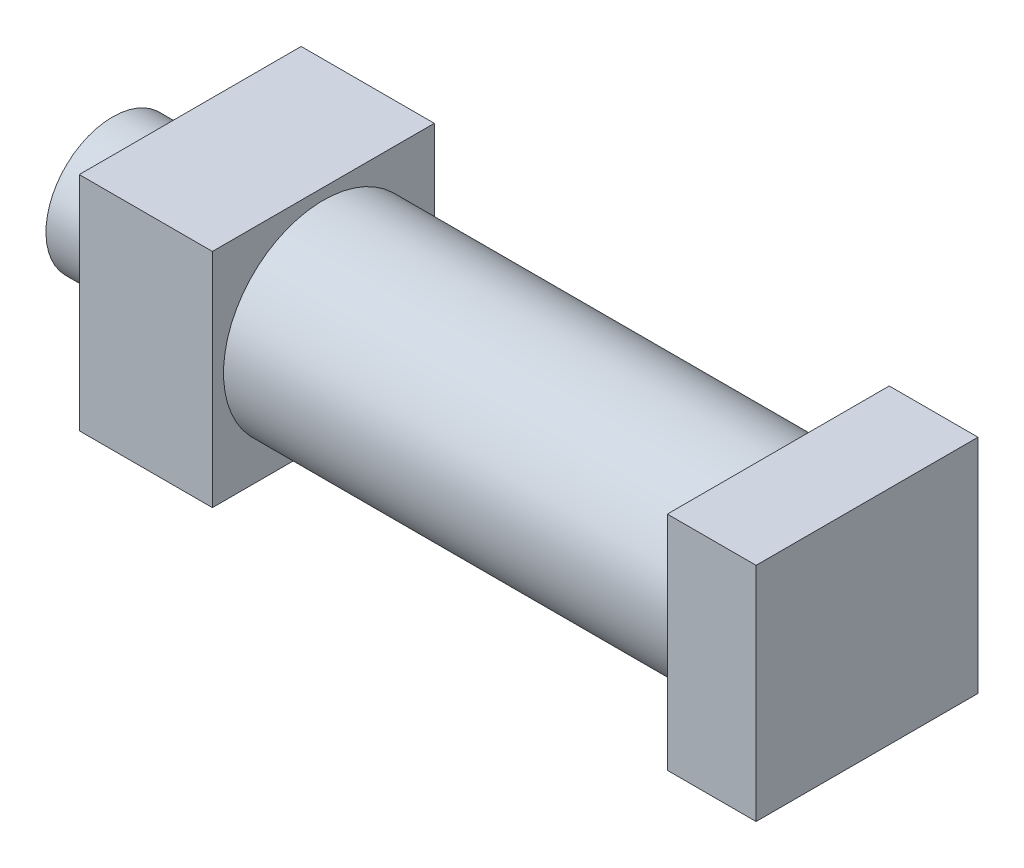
ISO-10303-21;
HEADER;
FILE_DESCRIPTION(('STEP AP214'),'2;1');
FILE_NAME('part.step','',(''),(''),'','','');
FILE_SCHEMA(('AUTOMOTIVE_DESIGN { 1 0 10303 214 1 1 1 1 }'));
ENDSEC;
DATA;
#1=APPLICATION_CONTEXT('core data for automotive mechanical design processes');
#2=APPLICATION_PROTOCOL_DEFINITION('international standard','automotive_design',2000,#1);
#3=PRODUCT_CONTEXT('',#1,'mechanical');
#4=PRODUCT('Part','Part','',(#3));
#5=PRODUCT_RELATED_PRODUCT_CATEGORY('part','',(#4));
#6=PRODUCT_DEFINITION_FORMATION('','',#4);
#7=PRODUCT_DEFINITION_CONTEXT('part definition',#1,'design');
#8=PRODUCT_DEFINITION('design','',#6,#7);
#9=PRODUCT_DEFINITION_SHAPE('','',#8);
#10=(LENGTH_UNIT() NAMED_UNIT(*) SI_UNIT(.MILLI.,.METRE.));
#11=(NAMED_UNIT(*) PLANE_ANGLE_UNIT() SI_UNIT($,.RADIAN.));
#12=(NAMED_UNIT(*) SI_UNIT($,.STERADIAN.) SOLID_ANGLE_UNIT());
#13=UNCERTAINTY_MEASURE_WITH_UNIT(LENGTH_MEASURE(1.E-05),#10,'distance_accuracy_value','');
#14=(GEOMETRIC_REPRESENTATION_CONTEXT(3) GLOBAL_UNCERTAINTY_ASSIGNED_CONTEXT((#13)) GLOBAL_UNIT_ASSIGNED_CONTEXT((#10,
#11,#12)) REPRESENTATION_CONTEXT('',''));
#15=CARTESIAN_POINT('',(0.,0.,0.));
#16=DIRECTION('',(0.,0.,1.));
#17=DIRECTION('',(1.,0.,0.));
#18=AXIS2_PLACEMENT_3D('',#15,#16,#17);
#19=CARTESIAN_POINT('',(-155.575,-31.75,-31.75));
#20=DIRECTION('',(0.,-1.,0.));
#21=DIRECTION('',(0.,0.,-1.));
#22=AXIS2_PLACEMENT_3D('',#19,#20,#21);
#23=PLANE('',#22);
#24=DIRECTION('',(0.,0.,1.));
#25=VECTOR('',#24,1.);
#26=CARTESIAN_POINT('',(-193.675,-31.75,-31.75));
#27=LINE('',#26,#25);
#28=CARTESIAN_POINT('',(-193.675,-31.75,-31.75));
#29=VERTEX_POINT('',#28);
#30=CARTESIAN_POINT('',(-193.675,-31.75,31.75));
#31=VERTEX_POINT('',#30);
#32=EDGE_CURVE('E145',#29,#31,#27,.T.);
#33=ORIENTED_EDGE('',*,*,#32,.F.);
#34=DIRECTION('',(-1.,0.,0.));
#35=VECTOR('',#34,1.);
#36=CARTESIAN_POINT('',(-155.575,-31.75,-31.75));
#37=LINE('',#36,#35);
#38=CARTESIAN_POINT('',(-155.575,-31.75,-31.75));
#39=VERTEX_POINT('',#38);
#40=EDGE_CURVE('E133',#39,#29,#37,.T.);
#41=ORIENTED_EDGE('',*,*,#40,.F.);
#42=DIRECTION('',(0.,0.,1.));
#43=VECTOR('',#42,1.);
#44=CARTESIAN_POINT('',(-155.575,-31.75,-31.75));
#45=LINE('',#44,#43);
#46=CARTESIAN_POINT('',(-155.575,-31.75,31.75));
#47=VERTEX_POINT('',#46);
#48=EDGE_CURVE('E127',#39,#47,#45,.T.);
#49=ORIENTED_EDGE('',*,*,#48,.T.);
#50=DIRECTION('',(-1.,0.,0.));
#51=VECTOR('',#50,1.);
#52=CARTESIAN_POINT('',(-155.575,-31.75,31.75));
#53=LINE('',#52,#51);
#54=EDGE_CURVE('E108',#47,#31,#53,.T.);
#55=ORIENTED_EDGE('',*,*,#54,.T.);
#56=EDGE_LOOP('',(#33,#41,#49,#55));
#57=FACE_BOUND('',#56,.T.);
#58=CARTESIAN_POINT('',(-174.625,-31.7499999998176,-11.1125));
#59=DIRECTION('',(0.,-1.,0.));
#60=DIRECTION('',(0.,0.,-1.));
#61=AXIS2_PLACEMENT_3D('',#58,#59,#60);
#62=CIRCLE('',#61,3.96874999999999);
#63=CARTESIAN_POINT('',(-174.625,-31.7499999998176,-15.08125));
#64=VERTEX_POINT('',#63);
#65=EDGE_CURVE('E291',#64,#64,#62,.T.);
#66=ORIENTED_EDGE('',*,*,#65,.F.);
#67=EDGE_LOOP('',(#66));
#68=FACE_BOUND('',#67,.T.);
#69=CARTESIAN_POINT('',(-174.625,-31.7499999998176,11.1125));
#70=DIRECTION('',(0.,1.,0.));
#71=DIRECTION('',(0.,0.,1.));
#72=AXIS2_PLACEMENT_3D('',#69,#70,#71);
#73=CIRCLE('',#72,3.96874999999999);
#74=CARTESIAN_POINT('',(-174.625,-31.7499999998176,7.14375));
#75=VERTEX_POINT('',#74);
#76=EDGE_CURVE('E292',#75,#75,#73,.T.);
#77=ORIENTED_EDGE('',*,*,#76,.T.);
#78=EDGE_LOOP('',(#77));
#79=FACE_BOUND('',#78,.T.);
#80=ADVANCED_FACE('F32',(#57,#68,#79),#23,.T.);
#81=CARTESIAN_POINT('',(-25.4,-31.75,-31.75));
#82=DIRECTION('',(0.,1.,0.));
#83=DIRECTION('',(0.,0.,1.));
#84=AXIS2_PLACEMENT_3D('',#81,#82,#83);
#85=PLANE('',#84);
#86=DIRECTION('',(0.,0.,1.));
#87=VECTOR('',#86,1.);
#88=CARTESIAN_POINT('',(0.,-31.75,-31.75));
#89=LINE('',#88,#87);
#90=CARTESIAN_POINT('',(0.,-31.75,-31.75));
#91=VERTEX_POINT('',#90);
#92=CARTESIAN_POINT('',(0.,-31.75,31.75));
#93=VERTEX_POINT('',#92);
#94=EDGE_CURVE('E175',#91,#93,#89,.T.);
#95=ORIENTED_EDGE('',*,*,#94,.T.);
#96=DIRECTION('',(1.,0.,0.));
#97=VECTOR('',#96,1.);
#98=CARTESIAN_POINT('',(-25.4,-31.75,31.75));
#99=LINE('',#98,#97);
#100=CARTESIAN_POINT('',(-25.4,-31.75,31.75));
#101=VERTEX_POINT('',#100);
#102=EDGE_CURVE('E172',#101,#93,#99,.T.);
#103=ORIENTED_EDGE('',*,*,#102,.F.);
#104=DIRECTION('',(0.,0.,1.));
#105=VECTOR('',#104,1.);
#106=CARTESIAN_POINT('',(-25.4,-31.75,-31.75));
#107=LINE('',#106,#105);
#108=CARTESIAN_POINT('',(-25.4,-31.75,-31.75));
#109=VERTEX_POINT('',#108);
#110=EDGE_CURVE('E79',#109,#101,#107,.T.);
#111=ORIENTED_EDGE('',*,*,#110,.F.);
#112=DIRECTION('',(1.,0.,0.));
#113=VECTOR('',#112,1.);
#114=CARTESIAN_POINT('',(-25.4,-31.75,-31.75));
#115=LINE('',#114,#113);
#116=EDGE_CURVE('E184',#109,#91,#115,.T.);
#117=ORIENTED_EDGE('',*,*,#116,.T.);
#118=EDGE_LOOP('',(#95,#103,#111,#117));
#119=FACE_BOUND('',#118,.T.);
#120=CARTESIAN_POINT('',(-12.7,-31.7499999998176,-11.1125));
#121=DIRECTION('',(0.,-1.,0.));
#122=DIRECTION('',(0.,0.,-1.));
#123=AXIS2_PLACEMENT_3D('',#120,#121,#122);
#124=CIRCLE('',#123,3.96874999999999);
#125=CARTESIAN_POINT('',(-12.7,-31.7499999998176,-15.08125));
#126=VERTEX_POINT('',#125);
#127=EDGE_CURVE('E306',#126,#126,#124,.T.);
#128=ORIENTED_EDGE('',*,*,#127,.F.);
#129=EDGE_LOOP('',(#128));
#130=FACE_BOUND('',#129,.T.);
#131=CARTESIAN_POINT('',(-12.7,-31.7499999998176,11.1125));
#132=DIRECTION('',(0.,1.,0.));
#133=DIRECTION('',(0.,0.,1.));
#134=AXIS2_PLACEMENT_3D('',#131,#132,#133);
#135=CIRCLE('',#134,3.96874999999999);
#136=CARTESIAN_POINT('',(-12.7,-31.7499999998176,7.14375000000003));
#137=VERTEX_POINT('',#136);
#138=EDGE_CURVE('E301',#137,#137,#135,.T.);
#139=ORIENTED_EDGE('',*,*,#138,.T.);
#140=EDGE_LOOP('',(#139));
#141=FACE_BOUND('',#140,.T.);
#142=ADVANCED_FACE('F211',(#119,#130,#141),#85,.F.);
#143=CARTESIAN_POINT('',(-25.4,-31.75,31.75));
#144=DIRECTION('',(-1.,0.,0.));
#145=DIRECTION('',(0.,0.,1.));
#146=AXIS2_PLACEMENT_3D('',#143,#144,#145);
#147=PLANE('',#146);
#148=DIRECTION('',(0.,-1.,0.));
#149=VECTOR('',#148,1.);
#150=CARTESIAN_POINT('',(-25.4,31.75,31.75));
#151=LINE('',#150,#149);
#152=CARTESIAN_POINT('',(-25.4,31.75,31.75));
#153=VERTEX_POINT('',#152);
#154=EDGE_CURVE('E164',#153,#101,#151,.T.);
#155=ORIENTED_EDGE('',*,*,#154,.F.);
#156=DIRECTION('',(0.,0.,-1.));
#157=VECTOR('',#156,1.);
#158=CARTESIAN_POINT('',(-25.4,31.75,31.75));
#159=LINE('',#158,#157);
#160=CARTESIAN_POINT('',(-25.4,31.75,-31.75));
#161=VERTEX_POINT('',#160);
#162=EDGE_CURVE('E170',#153,#161,#159,.T.);
#163=ORIENTED_EDGE('',*,*,#162,.T.);
#164=DIRECTION('',(0.,1.,0.));
#165=VECTOR('',#164,1.);
#166=CARTESIAN_POINT('',(-25.4,-31.75,-31.75));
#167=LINE('',#166,#165);
#168=EDGE_CURVE('E168',#109,#161,#167,.T.);
#169=ORIENTED_EDGE('',*,*,#168,.F.);
#170=ORIENTED_EDGE('',*,*,#110,.T.);
#171=EDGE_LOOP('',(#155,#163,#169,#170));
#172=FACE_BOUND('',#171,.T.);
#173=CARTESIAN_POINT('',(-25.4,0.,0.));
#174=DIRECTION('',(-1.,0.,0.));
#175=DIRECTION('',(0.,0.,1.));
#176=AXIS2_PLACEMENT_3D('',#173,#174,#175);
#177=CIRCLE('',#176,28.575);
#178=CARTESIAN_POINT('',(-25.4,0.,28.575));
#179=VERTEX_POINT('',#178);
#180=EDGE_CURVE('E157',#179,#179,#177,.F.);
#181=ORIENTED_EDGE('',*,*,#180,.T.);
#182=EDGE_LOOP('',(#181));
#183=FACE_BOUND('',#182,.T.);
#184=ADVANCED_FACE('F201',(#172,#183),#147,.T.);
#185=CARTESIAN_POINT('',(-25.4,31.75,31.75));
#186=DIRECTION('',(0.,0.,1.));
#187=DIRECTION('',(0.,-1.,0.));
#188=AXIS2_PLACEMENT_3D('',#185,#186,#187);
#189=PLANE('',#188);
#190=DIRECTION('',(0.,-1.,0.));
#191=VECTOR('',#190,1.);
#192=CARTESIAN_POINT('',(0.,31.75,31.75));
#193=LINE('',#192,#191);
#194=CARTESIAN_POINT('',(0.,31.75,31.75));
#195=VERTEX_POINT('',#194);
#196=EDGE_CURVE('E163',#195,#93,#193,.T.);
#197=ORIENTED_EDGE('',*,*,#196,.F.);
#198=DIRECTION('',(1.,0.,0.));
#199=VECTOR('',#198,1.);
#200=CARTESIAN_POINT('',(-25.4,31.75,31.75));
#201=LINE('',#200,#199);
#202=EDGE_CURVE('E49',#153,#195,#201,.T.);
#203=ORIENTED_EDGE('',*,*,#202,.F.);
#204=ORIENTED_EDGE('',*,*,#154,.T.);
#205=ORIENTED_EDGE('',*,*,#102,.T.);
#206=EDGE_LOOP('',(#197,#203,#204,#205));
#207=FACE_BOUND('',#206,.T.);
#208=ADVANCED_FACE('F34',(#207),#189,.T.);
#209=CARTESIAN_POINT('',(-25.4,31.75,31.75));
#210=DIRECTION('',(0.,-1.,0.));
#211=DIRECTION('',(0.,0.,-1.));
#212=AXIS2_PLACEMENT_3D('',#209,#210,#211);
#213=PLANE('',#212);
#214=DIRECTION('',(0.,0.,-1.));
#215=VECTOR('',#214,1.);
#216=CARTESIAN_POINT('',(0.,31.75,31.75));
#217=LINE('',#216,#215);
#218=CARTESIAN_POINT('',(0.,31.75,-31.75));
#219=VERTEX_POINT('',#218);
#220=EDGE_CURVE('E166',#195,#219,#217,.T.);
#221=ORIENTED_EDGE('',*,*,#220,.T.);
#222=DIRECTION('',(1.,0.,0.));
#223=VECTOR('',#222,1.);
#224=CARTESIAN_POINT('',(-25.4,31.75,-31.75));
#225=LINE('',#224,#223);
#226=EDGE_CURVE('E68',#161,#219,#225,.T.);
#227=ORIENTED_EDGE('',*,*,#226,.F.);
#228=ORIENTED_EDGE('',*,*,#162,.F.);
#229=ORIENTED_EDGE('',*,*,#202,.T.);
#230=EDGE_LOOP('',(#221,#227,#228,#229));
#231=FACE_BOUND('',#230,.T.);
#232=ADVANCED_FACE('F435',(#231),#213,.F.);
#233=CARTESIAN_POINT('',(-25.4,-31.75,-31.75));
#234=DIRECTION('',(0.,0.,-1.));
#235=DIRECTION('',(0.,1.,0.));
#236=AXIS2_PLACEMENT_3D('',#233,#234,#235);
#237=PLANE('',#236);
#238=DIRECTION('',(0.,1.,0.));
#239=VECTOR('',#238,1.);
#240=CARTESIAN_POINT('',(0.,-31.75,-31.75));
#241=LINE('',#240,#239);
#242=EDGE_CURVE('E178',#91,#219,#241,.T.);
#243=ORIENTED_EDGE('',*,*,#242,.F.);
#244=ORIENTED_EDGE('',*,*,#116,.F.);
#245=ORIENTED_EDGE('',*,*,#168,.T.);
#246=ORIENTED_EDGE('',*,*,#226,.T.);
#247=EDGE_LOOP('',(#243,#244,#245,#246));
#248=FACE_BOUND('',#247,.T.);
#249=ADVANCED_FACE('F441',(#248),#237,.T.);
#250=CARTESIAN_POINT('',(0.,-31.75,31.75));
#251=DIRECTION('',(-1.,0.,0.));
#252=DIRECTION('',(0.,0.,1.));
#253=AXIS2_PLACEMENT_3D('',#250,#251,#252);
#254=PLANE('',#253);
#255=ORIENTED_EDGE('',*,*,#196,.T.);
#256=ORIENTED_EDGE('',*,*,#94,.F.);
#257=ORIENTED_EDGE('',*,*,#242,.T.);
#258=ORIENTED_EDGE('',*,*,#220,.F.);
#259=EDGE_LOOP('',(#255,#256,#257,#258));
#260=FACE_BOUND('',#259,.T.);
#261=ADVANCED_FACE('F223',(#260),#254,.F.);
#262=CARTESIAN_POINT('',(-274.497305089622,0.,0.));
#263=DIRECTION('',(1.,0.,0.));
#264=DIRECTION('',(0.,0.,-1.));
#265=AXIS2_PLACEMENT_3D('',#262,#263,#264);
#266=CYLINDRICAL_SURFACE('',#265,28.575);
#267=CARTESIAN_POINT('',(-155.575,0.,0.));
#268=DIRECTION('',(1.,0.,0.));
#269=DIRECTION('',(0.,0.,-1.));
#270=AXIS2_PLACEMENT_3D('',#267,#268,#269);
#271=CIRCLE('',#270,28.575);
#272=CARTESIAN_POINT('',(-155.575,0.,-28.575));
#273=VERTEX_POINT('',#272);
#274=EDGE_CURVE('E151',#273,#273,#271,.T.);
#275=ORIENTED_EDGE('',*,*,#274,.T.);
#276=EDGE_LOOP('',(#275));
#277=FACE_BOUND('',#276,.T.);
#278=ORIENTED_EDGE('',*,*,#180,.F.);
#279=EDGE_LOOP('',(#278));
#280=FACE_BOUND('',#279,.T.);
#281=ADVANCED_FACE('F221',(#277,#280),#266,.T.);
#282=CARTESIAN_POINT('',(-155.575,-31.75,-31.75));
#283=DIRECTION('',(1.,0.,0.));
#284=DIRECTION('',(0.,0.,-1.));
#285=AXIS2_PLACEMENT_3D('',#282,#283,#284);
#286=PLANE('',#285);
#287=ORIENTED_EDGE('',*,*,#48,.F.);
#288=DIRECTION('',(0.,-1.,0.));
#289=VECTOR('',#288,1.);
#290=CARTESIAN_POINT('',(-155.575,31.75,-31.75));
#291=LINE('',#290,#289);
#292=CARTESIAN_POINT('',(-155.575,31.75,-31.75));
#293=VERTEX_POINT('',#292);
#294=EDGE_CURVE('E119',#293,#39,#291,.T.);
#295=ORIENTED_EDGE('',*,*,#294,.F.);
#296=DIRECTION('',(0.,0.,-1.));
#297=VECTOR('',#296,1.);
#298=CARTESIAN_POINT('',(-155.575,31.75,31.75));
#299=LINE('',#298,#297);
#300=CARTESIAN_POINT('',(-155.575,31.75,31.75));
#301=VERTEX_POINT('',#300);
#302=EDGE_CURVE('E130',#301,#293,#299,.T.);
#303=ORIENTED_EDGE('',*,*,#302,.F.);
#304=DIRECTION('',(0.,1.,0.));
#305=VECTOR('',#304,1.);
#306=CARTESIAN_POINT('',(-155.575,-31.75,31.75));
#307=LINE('',#306,#305);
#308=EDGE_CURVE('E111',#47,#301,#307,.T.);
#309=ORIENTED_EDGE('',*,*,#308,.F.);
#310=EDGE_LOOP('',(#287,#295,#303,#309));
#311=FACE_BOUND('',#310,.T.);
#312=ORIENTED_EDGE('',*,*,#274,.F.);
#313=EDGE_LOOP('',(#312));
#314=FACE_BOUND('',#313,.T.);
#315=ADVANCED_FACE('F124',(#311,#314),#286,.T.);
#316=CARTESIAN_POINT('',(-155.575,31.75,-31.75));
#317=DIRECTION('',(0.,0.,-1.));
#318=DIRECTION('',(0.,1.,0.));
#319=AXIS2_PLACEMENT_3D('',#316,#317,#318);
#320=PLANE('',#319);
#321=DIRECTION('',(0.,-1.,0.));
#322=VECTOR('',#321,1.);
#323=CARTESIAN_POINT('',(-193.675,31.75,-31.75));
#324=LINE('',#323,#322);
#325=CARTESIAN_POINT('',(-193.675,31.75,-31.75));
#326=VERTEX_POINT('',#325);
#327=EDGE_CURVE('E134',#326,#29,#324,.T.);
#328=ORIENTED_EDGE('',*,*,#327,.F.);
#329=DIRECTION('',(-1.,0.,0.));
#330=VECTOR('',#329,1.);
#331=CARTESIAN_POINT('',(-155.575,31.75,-31.75));
#332=LINE('',#331,#330);
#333=EDGE_CURVE('E152',#293,#326,#332,.T.);
#334=ORIENTED_EDGE('',*,*,#333,.F.);
#335=ORIENTED_EDGE('',*,*,#294,.T.);
#336=ORIENTED_EDGE('',*,*,#40,.T.);
#337=EDGE_LOOP('',(#328,#334,#335,#336));
#338=FACE_BOUND('',#337,.T.);
#339=ADVANCED_FACE('F242',(#338),#320,.T.);
#340=CARTESIAN_POINT('',(-155.575,31.75,31.75));
#341=DIRECTION('',(0.,1.,0.));
#342=DIRECTION('',(-1.,0.,0.));
#343=AXIS2_PLACEMENT_3D('',#340,#341,#342);
#344=PLANE('',#343);
#345=DIRECTION('',(0.,0.,-1.));
#346=VECTOR('',#345,1.);
#347=CARTESIAN_POINT('',(-193.675,31.75,31.75));
#348=LINE('',#347,#346);
#349=CARTESIAN_POINT('',(-193.675,31.75,31.75));
#350=VERTEX_POINT('',#349);
#351=EDGE_CURVE('E137',#350,#326,#348,.T.);
#352=ORIENTED_EDGE('',*,*,#351,.F.);
#353=DIRECTION('',(-1.,0.,0.));
#354=VECTOR('',#353,1.);
#355=CARTESIAN_POINT('',(-155.575,31.75,31.75));
#356=LINE('',#355,#354);
#357=EDGE_CURVE('E118',#301,#350,#356,.T.);
#358=ORIENTED_EDGE('',*,*,#357,.F.);
#359=ORIENTED_EDGE('',*,*,#302,.T.);
#360=ORIENTED_EDGE('',*,*,#333,.T.);
#361=EDGE_LOOP('',(#352,#358,#359,#360));
#362=FACE_BOUND('',#361,.T.);
#363=ADVANCED_FACE('F236',(#362),#344,.T.);
#364=CARTESIAN_POINT('',(-155.575,-31.75,31.75));
#365=DIRECTION('',(0.,0.,1.));
#366=DIRECTION('',(0.,-1.,0.));
#367=AXIS2_PLACEMENT_3D('',#364,#365,#366);
#368=PLANE('',#367);
#369=DIRECTION('',(0.,1.,0.));
#370=VECTOR('',#369,1.);
#371=CARTESIAN_POINT('',(-193.675,-31.75,31.75));
#372=LINE('',#371,#370);
#373=EDGE_CURVE('E113',#31,#350,#372,.T.);
#374=ORIENTED_EDGE('',*,*,#373,.F.);
#375=ORIENTED_EDGE('',*,*,#54,.F.);
#376=ORIENTED_EDGE('',*,*,#308,.T.);
#377=ORIENTED_EDGE('',*,*,#357,.T.);
#378=EDGE_LOOP('',(#374,#375,#376,#377));
#379=FACE_BOUND('',#378,.T.);
#380=ADVANCED_FACE('F110',(#379),#368,.T.);
#381=CARTESIAN_POINT('',(-193.675,0.,0.));
#382=DIRECTION('',(-1.,0.,0.));
#383=DIRECTION('',(0.,-1.,0.));
#384=AXIS2_PLACEMENT_3D('',#381,#382,#383);
#385=PLANE('',#384);
#386=CARTESIAN_POINT('',(-193.675,0.,0.));
#387=DIRECTION('',(-1.,0.,0.));
#388=DIRECTION('',(0.,-1.,0.));
#389=AXIS2_PLACEMENT_3D('',#386,#387,#388);
#390=CIRCLE('',#389,19.05);
#391=CARTESIAN_POINT('',(-193.675,-19.05,0.));
#392=VERTEX_POINT('',#391);
#393=EDGE_CURVE('E11',#392,#392,#390,.T.);
#394=ORIENTED_EDGE('',*,*,#393,.F.);
#395=EDGE_LOOP('',(#394));
#396=FACE_BOUND('',#395,.T.);
#397=ORIENTED_EDGE('',*,*,#32,.T.);
#398=ORIENTED_EDGE('',*,*,#373,.T.);
#399=ORIENTED_EDGE('',*,*,#351,.T.);
#400=ORIENTED_EDGE('',*,*,#327,.T.);
#401=EDGE_LOOP('',(#397,#398,#399,#400));
#402=FACE_BOUND('',#401,.T.);
#403=ADVANCED_FACE('F225',(#396,#402),#385,.T.);
#404=CARTESIAN_POINT('',(-215.9,0.,0.));
#405=DIRECTION('',(1.,0.,0.));
#406=DIRECTION('',(0.,1.,0.));
#407=AXIS2_PLACEMENT_3D('',#404,#405,#406);
#408=CYLINDRICAL_SURFACE('',#407,19.05);
#409=CARTESIAN_POINT('',(-215.9,0.,0.));
#410=DIRECTION('',(1.,0.,0.));
#411=DIRECTION('',(0.,1.,0.));
#412=AXIS2_PLACEMENT_3D('',#409,#410,#411);
#413=CIRCLE('',#412,19.05);
#414=CARTESIAN_POINT('',(-215.9,19.05,0.));
#415=VERTEX_POINT('',#414);
#416=EDGE_CURVE('E140',#415,#415,#413,.T.);
#417=ORIENTED_EDGE('',*,*,#416,.T.);
#418=EDGE_LOOP('',(#417));
#419=FACE_BOUND('',#418,.T.);
#420=ORIENTED_EDGE('',*,*,#393,.T.);
#421=EDGE_LOOP('',(#420));
#422=FACE_BOUND('',#421,.T.);
#423=ADVANCED_FACE('F227',(#419,#422),#408,.T.);
#424=CARTESIAN_POINT('',(-215.9,0.,0.));
#425=DIRECTION('',(1.,0.,0.));
#426=DIRECTION('',(0.,1.,0.));
#427=AXIS2_PLACEMENT_3D('',#424,#425,#426);
#428=PLANE('',#427);
#429=CARTESIAN_POINT('',(-215.9,0.,0.));
#430=DIRECTION('',(-1.,0.,0.));
#431=DIRECTION('',(0.,-1.,0.));
#432=AXIS2_PLACEMENT_3D('',#429,#430,#431);
#433=CIRCLE('',#432,12.7);
#434=CARTESIAN_POINT('',(-215.9,-12.7,0.));
#435=VERTEX_POINT('',#434);
#436=EDGE_CURVE('E312',#435,#435,#433,.T.);
#437=ORIENTED_EDGE('',*,*,#436,.F.);
#438=EDGE_LOOP('',(#437));
#439=FACE_BOUND('',#438,.T.);
#440=ORIENTED_EDGE('',*,*,#416,.F.);
#441=EDGE_LOOP('',(#440));
#442=FACE_BOUND('',#441,.T.);
#443=ADVANCED_FACE('F233',(#439,#442),#428,.F.);
#444=CARTESIAN_POINT('',(10.5210244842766,0.,0.));
#445=DIRECTION('',(-1.,0.,0.));
#446=DIRECTION('',(0.,-1.,0.));
#447=AXIS2_PLACEMENT_3D('',#444,#445,#446);
#448=CYLINDRICAL_SURFACE('',#447,12.7);
#449=CARTESIAN_POINT('',(-155.575,0.,0.));
#450=DIRECTION('',(1.,0.,0.));
#451=DIRECTION('',(0.,0.,-1.));
#452=AXIS2_PLACEMENT_3D('',#449,#450,#451);
#453=CIRCLE('',#452,12.7);
#454=CARTESIAN_POINT('',(-155.575,0.,-12.7));
#455=VERTEX_POINT('',#454);
#456=EDGE_CURVE('E316',#455,#455,#453,.T.);
#457=ORIENTED_EDGE('',*,*,#456,.T.);
#458=EDGE_LOOP('',(#457));
#459=FACE_BOUND('',#458,.T.);
#460=ORIENTED_EDGE('',*,*,#436,.T.);
#461=EDGE_LOOP('',(#460));
#462=FACE_BOUND('',#461,.T.);
#463=ADVANCED_FACE('F205',(#459,#462),#448,.F.);
#464=ORIENTED_EDGE('',*,*,#456,.F.);
#465=EDGE_LOOP('',(#464));
#466=FACE_BOUND('',#465,.T.);
#467=CARTESIAN_POINT('',(-155.575,0.,0.));
#468=DIRECTION('',(1.,0.,0.));
#469=DIRECTION('',(0.,0.,-1.));
#470=AXIS2_PLACEMENT_3D('',#467,#468,#469);
#471=CIRCLE('',#470,25.4);
#472=CARTESIAN_POINT('',(-155.575,0.,-25.4));
#473=VERTEX_POINT('',#472);
#474=EDGE_CURVE('E41',#473,#473,#471,.T.);
#475=ORIENTED_EDGE('',*,*,#474,.T.);
#476=EDGE_LOOP('',(#475));
#477=FACE_BOUND('',#476,.T.);
#478=ADVANCED_FACE('F189',(#466,#477),#286,.T.);
#479=CARTESIAN_POINT('',(-25.4,0.,0.));
#480=DIRECTION('',(-1.,0.,0.));
#481=DIRECTION('',(0.,0.,1.));
#482=AXIS2_PLACEMENT_3D('',#479,#480,#481);
#483=CIRCLE('',#482,25.4);
#484=CARTESIAN_POINT('',(-25.4,0.,25.4));
#485=VERTEX_POINT('',#484);
#486=EDGE_CURVE('E158',#485,#485,#483,.F.);
#487=ORIENTED_EDGE('',*,*,#486,.F.);
#488=EDGE_LOOP('',(#487));
#489=FACE_BOUND('',#488,.T.);
#490=ADVANCED_FACE('F195',(#489),#147,.T.);
#491=CARTESIAN_POINT('',(-274.497305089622,0.,0.));
#492=DIRECTION('',(1.,0.,0.));
#493=DIRECTION('',(0.,0.,-1.));
#494=AXIS2_PLACEMENT_3D('',#491,#492,#493);
#495=CYLINDRICAL_SURFACE('',#494,25.4);
#496=ORIENTED_EDGE('',*,*,#474,.F.);
#497=EDGE_LOOP('',(#496));
#498=FACE_BOUND('',#497,.T.);
#499=ORIENTED_EDGE('',*,*,#486,.T.);
#500=EDGE_LOOP('',(#499));
#501=FACE_BOUND('',#500,.T.);
#502=ADVANCED_FACE('F191',(#498,#501),#495,.F.);
#503=CARTESIAN_POINT('',(-12.7,-12.6999999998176,-11.1125));
#504=DIRECTION('',(0.,-1.,0.));
#505=DIRECTION('',(0.,0.,-1.));
#506=AXIS2_PLACEMENT_3D('',#503,#504,#505);
#507=CYLINDRICAL_SURFACE('',#506,3.96874999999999);
#508=CARTESIAN_POINT('',(-12.7,-12.6999999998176,-11.1125));
#509=DIRECTION('',(0.,-1.,0.));
#510=DIRECTION('',(0.,0.,-1.));
#511=AXIS2_PLACEMENT_3D('',#508,#509,#510);
#512=CIRCLE('',#511,3.96874999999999);
#513=CARTESIAN_POINT('',(-12.7,-12.6999999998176,-15.08125));
#514=VERTEX_POINT('',#513);
#515=EDGE_CURVE('E309',#514,#514,#512,.T.);
#516=CARTESIAN_POINT('',(-12.7,-12.6999999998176,-15.08125));
#517=CARTESIAN_POINT('',(-12.7,-12.8984374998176,-15.08125));
#518=CARTESIAN_POINT('',(-12.7,-13.0968749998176,-15.08125));
#519=CARTESIAN_POINT('',(-12.7,-13.4937499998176,-15.08125));
#520=CARTESIAN_POINT('',(-12.7,-13.6921874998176,-15.08125));
#521=CARTESIAN_POINT('',(-12.7,-14.0890624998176,-15.08125));
#522=CARTESIAN_POINT('',(-12.7,-14.2874999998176,-15.08125));
#523=CARTESIAN_POINT('',(-12.7,-14.6843749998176,-15.08125));
#524=CARTESIAN_POINT('',(-12.7,-14.8828124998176,-15.08125));
#525=CARTESIAN_POINT('',(-12.7,-15.2796874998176,-15.08125));
#526=CARTESIAN_POINT('',(-12.7,-15.4781249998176,-15.08125));
#527=CARTESIAN_POINT('',(-12.7,-15.8749999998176,-15.08125));
#528=CARTESIAN_POINT('',(-12.7,-16.0734374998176,-15.08125));
#529=CARTESIAN_POINT('',(-12.7,-16.4703124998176,-15.08125));
#530=CARTESIAN_POINT('',(-12.7,-16.6687499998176,-15.08125));
#531=CARTESIAN_POINT('',(-12.7,-17.0656249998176,-15.08125));
#532=CARTESIAN_POINT('',(-12.7,-17.2640624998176,-15.08125));
#533=CARTESIAN_POINT('',(-12.7,-17.6609374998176,-15.08125));
#534=CARTESIAN_POINT('',(-12.7,-17.8593749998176,-15.08125));
#535=CARTESIAN_POINT('',(-12.7,-18.2562499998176,-15.08125));
#536=CARTESIAN_POINT('',(-12.7,-18.4546874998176,-15.08125));
#537=CARTESIAN_POINT('',(-12.7,-18.8515624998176,-15.08125));
#538=CARTESIAN_POINT('',(-12.7,-19.0499999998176,-15.08125));
#539=CARTESIAN_POINT('',(-12.7,-19.4468749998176,-15.08125));
#540=CARTESIAN_POINT('',(-12.7,-19.6453124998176,-15.08125));
#541=CARTESIAN_POINT('',(-12.7,-20.0421874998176,-15.08125));
#542=CARTESIAN_POINT('',(-12.7,-20.2406249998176,-15.08125));
#543=CARTESIAN_POINT('',(-12.7,-20.6374999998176,-15.08125));
#544=CARTESIAN_POINT('',(-12.7,-20.8359374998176,-15.08125));
#545=CARTESIAN_POINT('',(-12.7,-21.2328124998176,-15.08125));
#546=CARTESIAN_POINT('',(-12.7,-21.4312499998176,-15.08125));
#547=CARTESIAN_POINT('',(-12.7,-21.8281249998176,-15.08125));
#548=CARTESIAN_POINT('',(-12.7,-22.0265624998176,-15.08125));
#549=CARTESIAN_POINT('',(-12.7,-22.4234374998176,-15.08125));
#550=CARTESIAN_POINT('',(-12.7,-22.6218749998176,-15.08125));
#551=CARTESIAN_POINT('',(-12.7,-23.0187499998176,-15.08125));
#552=CARTESIAN_POINT('',(-12.7,-23.2171874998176,-15.08125));
#553=CARTESIAN_POINT('',(-12.7,-23.6140624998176,-15.08125));
#554=CARTESIAN_POINT('',(-12.7,-23.8124999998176,-15.08125));
#555=CARTESIAN_POINT('',(-12.7,-24.2093749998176,-15.08125));
#556=CARTESIAN_POINT('',(-12.7,-24.4078124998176,-15.08125));
#557=CARTESIAN_POINT('',(-12.7,-24.8046874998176,-15.08125));
#558=CARTESIAN_POINT('',(-12.7,-25.0031249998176,-15.08125));
#559=CARTESIAN_POINT('',(-12.7,-25.3999999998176,-15.08125));
#560=CARTESIAN_POINT('',(-12.7,-25.5984374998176,-15.08125));
#561=CARTESIAN_POINT('',(-12.7,-25.9953124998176,-15.08125));
#562=CARTESIAN_POINT('',(-12.7,-26.1937499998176,-15.08125));
#563=CARTESIAN_POINT('',(-12.7,-26.5906249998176,-15.08125));
#564=CARTESIAN_POINT('',(-12.7,-26.7890624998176,-15.08125));
#565=CARTESIAN_POINT('',(-12.7,-27.1859374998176,-15.08125));
#566=CARTESIAN_POINT('',(-12.7,-27.3843749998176,-15.08125));
#567=CARTESIAN_POINT('',(-12.7,-27.7812499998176,-15.08125));
#568=CARTESIAN_POINT('',(-12.7,-27.9796874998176,-15.08125));
#569=CARTESIAN_POINT('',(-12.7,-28.3765624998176,-15.08125));
#570=CARTESIAN_POINT('',(-12.7,-28.5749999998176,-15.08125));
#571=CARTESIAN_POINT('',(-12.7,-28.9718749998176,-15.08125));
#572=CARTESIAN_POINT('',(-12.7,-29.1703124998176,-15.08125));
#573=CARTESIAN_POINT('',(-12.7,-29.5671874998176,-15.08125));
#574=CARTESIAN_POINT('',(-12.7,-29.7656249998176,-15.08125));
#575=CARTESIAN_POINT('',(-12.7,-30.1624999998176,-15.08125));
#576=CARTESIAN_POINT('',(-12.7,-30.3609374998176,-15.08125));
#577=CARTESIAN_POINT('',(-12.7,-30.7578124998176,-15.08125));
#578=CARTESIAN_POINT('',(-12.7,-30.9562499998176,-15.08125));
#579=CARTESIAN_POINT('',(-12.7,-31.3531249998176,-15.08125));
#580=CARTESIAN_POINT('',(-12.7,-31.5515624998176,-15.08125));
#581=CARTESIAN_POINT('',(-12.7,-31.7499999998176,-15.08125));
#582=B_SPLINE_CURVE_WITH_KNOTS('',3,(#516,#517,#518,#519,#520,#521,#522,#523,#524,#525,#526,
#527,#528,#529,#530,#531,#532,#533,#534,#535,#536,#537,#538,#539,#540,#541,#542,#543,#544,#545,
#546,#547,#548,#549,#550,#551,#552,#553,#554,#555,#556,#557,#558,#559,#560,#561,#562,#563,#564,
#565,#566,#567,#568,#569,#570,#571,#572,#573,#574,#575,#576,#577,#578,#579,#580,#581),
.UNSPECIFIED.,.F.,.F.,(4,2,2,2,2,2,2,2,2,2,2,2,2,2,2,2,2,2,2,2,2,2,2,2,2,2,2,2,2,2,2,2,4),(0.,
0.5953125,1.190625,1.7859375,2.38125,2.9765625,3.571875,4.1671875,4.7625,5.3578125,5.953125,
6.5484375,7.14375,7.7390625,8.334375,8.9296875,9.525,10.1203125,10.715625,11.3109375,11.90625,
12.5015625,13.096875,13.6921875,14.2875,14.8828125,15.478125,16.0734375,16.66875,17.2640625,
17.859375,18.4546875,19.05),.UNSPECIFIED.);
#583=EDGE_CURVE('BSEAM194',#514,#126,#582,.T.);
#584=ORIENTED_EDGE('',*,*,#515,.F.);
#585=ORIENTED_EDGE('',*,*,#127,.T.);
#586=ORIENTED_EDGE('',*,*,#583,.T.);
#587=ORIENTED_EDGE('',*,*,#583,.F.);
#588=EDGE_LOOP('',(#584,#586,#585,#587));
#589=FACE_BOUND('',#588,.T.);
#590=ADVANCED_FACE('F194',(#589),#507,.F.);
#591=CARTESIAN_POINT('',(-12.7,-12.6999999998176,-11.1125));
#592=DIRECTION('',(0.,-1.,0.));
#593=DIRECTION('',(0.,0.,-1.));
#594=AXIS2_PLACEMENT_3D('',#591,#592,#593);
#595=PLANE('',#594);
#596=ORIENTED_EDGE('',*,*,#515,.T.);
#597=EDGE_LOOP('',(#596));
#598=FACE_BOUND('',#597,.T.);
#599=ADVANCED_FACE('F258',(#598),#595,.T.);
#600=CARTESIAN_POINT('',(-12.7,-12.6999999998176,11.1125));
#601=DIRECTION('',(0.,-1.,0.));
#602=DIRECTION('',(0.,0.,-1.));
#603=AXIS2_PLACEMENT_3D('',#600,#601,#602);
#604=CYLINDRICAL_SURFACE('',#603,3.96874999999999);
#605=CARTESIAN_POINT('',(-12.7,-12.6999999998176,11.1125));
#606=DIRECTION('',(0.,1.,0.));
#607=DIRECTION('',(0.,0.,1.));
#608=AXIS2_PLACEMENT_3D('',#605,#606,#607);
#609=CIRCLE('',#608,3.96874999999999);
#610=CARTESIAN_POINT('',(-12.7,-12.6999999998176,7.14375000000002));
#611=VERTEX_POINT('',#610);
#612=EDGE_CURVE('E303',#611,#611,#609,.T.);
#613=CARTESIAN_POINT('',(-12.7,-12.6999999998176,7.14375000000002));
#614=CARTESIAN_POINT('',(-12.7,-12.8984374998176,7.14375000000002));
#615=CARTESIAN_POINT('',(-12.7,-13.0968749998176,7.14375000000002));
#616=CARTESIAN_POINT('',(-12.7,-13.4937499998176,7.14375000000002));
#617=CARTESIAN_POINT('',(-12.7,-13.6921874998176,7.14375000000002));
#618=CARTESIAN_POINT('',(-12.7,-14.0890624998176,7.14375000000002));
#619=CARTESIAN_POINT('',(-12.7,-14.2874999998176,7.14375000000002));
#620=CARTESIAN_POINT('',(-12.7,-14.6843749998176,7.14375000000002));
#621=CARTESIAN_POINT('',(-12.7,-14.8828124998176,7.14375000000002));
#622=CARTESIAN_POINT('',(-12.7,-15.2796874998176,7.14375000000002));
#623=CARTESIAN_POINT('',(-12.7,-15.4781249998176,7.14375000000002));
#624=CARTESIAN_POINT('',(-12.7,-15.8749999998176,7.14375000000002));
#625=CARTESIAN_POINT('',(-12.7,-16.0734374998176,7.14375000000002));
#626=CARTESIAN_POINT('',(-12.7,-16.4703124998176,7.14375000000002));
#627=CARTESIAN_POINT('',(-12.7,-16.6687499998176,7.14375000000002));
#628=CARTESIAN_POINT('',(-12.7,-17.0656249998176,7.14375000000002));
#629=CARTESIAN_POINT('',(-12.7,-17.2640624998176,7.14375000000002));
#630=CARTESIAN_POINT('',(-12.7,-17.6609374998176,7.14375000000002));
#631=CARTESIAN_POINT('',(-12.7,-17.8593749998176,7.14375000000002));
#632=CARTESIAN_POINT('',(-12.7,-18.2562499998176,7.14375000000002));
#633=CARTESIAN_POINT('',(-12.7,-18.4546874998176,7.14375000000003));
#634=CARTESIAN_POINT('',(-12.7,-18.8515624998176,7.14375000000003));
#635=CARTESIAN_POINT('',(-12.7,-19.0499999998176,7.14375000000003));
#636=CARTESIAN_POINT('',(-12.7,-19.4468749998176,7.14375000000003));
#637=CARTESIAN_POINT('',(-12.7,-19.6453124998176,7.14375000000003));
#638=CARTESIAN_POINT('',(-12.7,-20.0421874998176,7.14375000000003));
#639=CARTESIAN_POINT('',(-12.7,-20.2406249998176,7.14375000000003));
#640=CARTESIAN_POINT('',(-12.7,-20.6374999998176,7.14375000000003));
#641=CARTESIAN_POINT('',(-12.7,-20.8359374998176,7.14375000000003));
#642=CARTESIAN_POINT('',(-12.7,-21.2328124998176,7.14375000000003));
#643=CARTESIAN_POINT('',(-12.7,-21.4312499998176,7.14375000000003));
#644=CARTESIAN_POINT('',(-12.7,-21.8281249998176,7.14375000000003));
#645=CARTESIAN_POINT('',(-12.7,-22.0265624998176,7.14375000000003));
#646=CARTESIAN_POINT('',(-12.7,-22.4234374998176,7.14375000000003));
#647=CARTESIAN_POINT('',(-12.7,-22.6218749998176,7.14375000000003));
#648=CARTESIAN_POINT('',(-12.7,-23.0187499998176,7.14375000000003));
#649=CARTESIAN_POINT('',(-12.7,-23.2171874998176,7.14375000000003));
#650=CARTESIAN_POINT('',(-12.7,-23.6140624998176,7.14375000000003));
#651=CARTESIAN_POINT('',(-12.7,-23.8124999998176,7.14375000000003));
#652=CARTESIAN_POINT('',(-12.7,-24.2093749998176,7.14375000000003));
#653=CARTESIAN_POINT('',(-12.7,-24.4078124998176,7.14375000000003));
#654=CARTESIAN_POINT('',(-12.7,-24.8046874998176,7.14375000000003));
#655=CARTESIAN_POINT('',(-12.7,-25.0031249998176,7.14375000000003));
#656=CARTESIAN_POINT('',(-12.7,-25.3999999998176,7.14375000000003));
#657=CARTESIAN_POINT('',(-12.7,-25.5984374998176,7.14375000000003));
#658=CARTESIAN_POINT('',(-12.7,-25.9953124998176,7.14375000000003));
#659=CARTESIAN_POINT('',(-12.7,-26.1937499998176,7.14375000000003));
#660=CARTESIAN_POINT('',(-12.7,-26.5906249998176,7.14375000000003));
#661=CARTESIAN_POINT('',(-12.7,-26.7890624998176,7.14375000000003));
#662=CARTESIAN_POINT('',(-12.7,-27.1859374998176,7.14375000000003));
#663=CARTESIAN_POINT('',(-12.7,-27.3843749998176,7.14375000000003));
#664=CARTESIAN_POINT('',(-12.7,-27.7812499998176,7.14375000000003));
#665=CARTESIAN_POINT('',(-12.7,-27.9796874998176,7.14375000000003));
#666=CARTESIAN_POINT('',(-12.7,-28.3765624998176,7.14375000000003));
#667=CARTESIAN_POINT('',(-12.7,-28.5749999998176,7.14375000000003));
#668=CARTESIAN_POINT('',(-12.7,-28.9718749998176,7.14375000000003));
#669=CARTESIAN_POINT('',(-12.7,-29.1703124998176,7.14375000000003));
#670=CARTESIAN_POINT('',(-12.7,-29.5671874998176,7.14375000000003));
#671=CARTESIAN_POINT('',(-12.7,-29.7656249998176,7.14375000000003));
#672=CARTESIAN_POINT('',(-12.7,-30.1624999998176,7.14375000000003));
#673=CARTESIAN_POINT('',(-12.7,-30.3609374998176,7.14375000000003));
#674=CARTESIAN_POINT('',(-12.7,-30.7578124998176,7.14375000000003));
#675=CARTESIAN_POINT('',(-12.7,-30.9562499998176,7.14375000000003));
#676=CARTESIAN_POINT('',(-12.7,-31.3531249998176,7.14375000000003));
#677=CARTESIAN_POINT('',(-12.7,-31.5515624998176,7.14375000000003));
#678=CARTESIAN_POINT('',(-12.7,-31.7499999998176,7.14375000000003));
#679=B_SPLINE_CURVE_WITH_KNOTS('',3,(#613,#614,#615,#616,#617,#618,#619,#620,#621,#622,#623,
#624,#625,#626,#627,#628,#629,#630,#631,#632,#633,#634,#635,#636,#637,#638,#639,#640,#641,#642,
#643,#644,#645,#646,#647,#648,#649,#650,#651,#652,#653,#654,#655,#656,#657,#658,#659,#660,#661,
#662,#663,#664,#665,#666,#667,#668,#669,#670,#671,#672,#673,#674,#675,#676,#677,#678),
.UNSPECIFIED.,.F.,.F.,(4,2,2,2,2,2,2,2,2,2,2,2,2,2,2,2,2,2,2,2,2,2,2,2,2,2,2,2,2,2,2,2,4),(0.,
0.5953125,1.190625,1.7859375,2.38125,2.9765625,3.571875,4.1671875,4.7625,5.3578125,5.953125,
6.5484375,7.14375,7.7390625,8.334375,8.9296875,9.525,10.1203125,10.715625,11.3109375,11.90625,
12.5015625,13.096875,13.6921875,14.2875,14.8828125,15.478125,16.0734375,16.66875,17.2640625,
17.859375,18.4546875,19.05),.UNSPECIFIED.);
#680=EDGE_CURVE('BSEAM262',#611,#137,#679,.T.);
#681=ORIENTED_EDGE('',*,*,#612,.T.);
#682=ORIENTED_EDGE('',*,*,#138,.F.);
#683=ORIENTED_EDGE('',*,*,#680,.T.);
#684=ORIENTED_EDGE('',*,*,#680,.F.);
#685=EDGE_LOOP('',(#681,#683,#682,#684));
#686=FACE_BOUND('',#685,.T.);
#687=ADVANCED_FACE('F262',(#686),#604,.F.);
#688=CARTESIAN_POINT('',(-12.7,-12.6999999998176,11.1125));
#689=DIRECTION('',(0.,1.,0.));
#690=DIRECTION('',(0.,0.,1.));
#691=AXIS2_PLACEMENT_3D('',#688,#689,#690);
#692=PLANE('',#691);
#693=ORIENTED_EDGE('',*,*,#612,.F.);
#694=EDGE_LOOP('',(#693));
#695=FACE_BOUND('',#694,.T.);
#696=ADVANCED_FACE('F266',(#695),#692,.F.);
#697=CARTESIAN_POINT('',(-174.625,-12.6999999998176,-11.1125));
#698=DIRECTION('',(0.,-1.,0.));
#699=DIRECTION('',(0.,0.,-1.));
#700=AXIS2_PLACEMENT_3D('',#697,#698,#699);
#701=CYLINDRICAL_SURFACE('',#700,3.96874999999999);
#702=CARTESIAN_POINT('',(-174.625,-12.6999999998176,-11.1125));
#703=DIRECTION('',(0.,-1.,0.));
#704=DIRECTION('',(0.,0.,-1.));
#705=AXIS2_PLACEMENT_3D('',#702,#703,#704);
#706=CIRCLE('',#705,3.96874999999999);
#707=CARTESIAN_POINT('',(-174.625,-12.6999999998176,-15.08125));
#708=VERTEX_POINT('',#707);
#709=EDGE_CURVE('E295',#708,#708,#706,.T.);
#710=CARTESIAN_POINT('',(-174.625,-12.6999999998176,-15.08125));
#711=CARTESIAN_POINT('',(-174.625,-12.8984374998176,-15.08125));
#712=CARTESIAN_POINT('',(-174.625,-13.0968749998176,-15.08125));
#713=CARTESIAN_POINT('',(-174.625,-13.4937499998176,-15.08125));
#714=CARTESIAN_POINT('',(-174.625,-13.6921874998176,-15.08125));
#715=CARTESIAN_POINT('',(-174.625,-14.0890624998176,-15.08125));
#716=CARTESIAN_POINT('',(-174.625,-14.2874999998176,-15.08125));
#717=CARTESIAN_POINT('',(-174.625,-14.6843749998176,-15.08125));
#718=CARTESIAN_POINT('',(-174.625,-14.8828124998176,-15.08125));
#719=CARTESIAN_POINT('',(-174.625,-15.2796874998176,-15.08125));
#720=CARTESIAN_POINT('',(-174.625,-15.4781249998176,-15.08125));
#721=CARTESIAN_POINT('',(-174.625,-15.8749999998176,-15.08125));
#722=CARTESIAN_POINT('',(-174.625,-16.0734374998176,-15.08125));
#723=CARTESIAN_POINT('',(-174.625,-16.4703124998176,-15.08125));
#724=CARTESIAN_POINT('',(-174.625,-16.6687499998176,-15.08125));
#725=CARTESIAN_POINT('',(-174.625,-17.0656249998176,-15.08125));
#726=CARTESIAN_POINT('',(-174.625,-17.2640624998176,-15.08125));
#727=CARTESIAN_POINT('',(-174.625,-17.6609374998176,-15.08125));
#728=CARTESIAN_POINT('',(-174.625,-17.8593749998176,-15.08125));
#729=CARTESIAN_POINT('',(-174.625,-18.2562499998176,-15.08125));
#730=CARTESIAN_POINT('',(-174.625,-18.4546874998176,-15.08125));
#731=CARTESIAN_POINT('',(-174.625,-18.8515624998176,-15.08125));
#732=CARTESIAN_POINT('',(-174.625,-19.0499999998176,-15.08125));
#733=CARTESIAN_POINT('',(-174.625,-19.4468749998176,-15.08125));
#734=CARTESIAN_POINT('',(-174.625,-19.6453124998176,-15.08125));
#735=CARTESIAN_POINT('',(-174.625,-20.0421874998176,-15.08125));
#736=CARTESIAN_POINT('',(-174.625,-20.2406249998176,-15.08125));
#737=CARTESIAN_POINT('',(-174.625,-20.6374999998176,-15.08125));
#738=CARTESIAN_POINT('',(-174.625,-20.8359374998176,-15.08125));
#739=CARTESIAN_POINT('',(-174.625,-21.2328124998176,-15.08125));
#740=CARTESIAN_POINT('',(-174.625,-21.4312499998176,-15.08125));
#741=CARTESIAN_POINT('',(-174.625,-21.8281249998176,-15.08125));
#742=CARTESIAN_POINT('',(-174.625,-22.0265624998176,-15.08125));
#743=CARTESIAN_POINT('',(-174.625,-22.4234374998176,-15.08125));
#744=CARTESIAN_POINT('',(-174.625,-22.6218749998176,-15.08125));
#745=CARTESIAN_POINT('',(-174.625,-23.0187499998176,-15.08125));
#746=CARTESIAN_POINT('',(-174.625,-23.2171874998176,-15.08125));
#747=CARTESIAN_POINT('',(-174.625,-23.6140624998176,-15.08125));
#748=CARTESIAN_POINT('',(-174.625,-23.8124999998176,-15.08125));
#749=CARTESIAN_POINT('',(-174.625,-24.2093749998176,-15.08125));
#750=CARTESIAN_POINT('',(-174.625,-24.4078124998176,-15.08125));
#751=CARTESIAN_POINT('',(-174.625,-24.8046874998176,-15.08125));
#752=CARTESIAN_POINT('',(-174.625,-25.0031249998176,-15.08125));
#753=CARTESIAN_POINT('',(-174.625,-25.3999999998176,-15.08125));
#754=CARTESIAN_POINT('',(-174.625,-25.5984374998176,-15.08125));
#755=CARTESIAN_POINT('',(-174.625,-25.9953124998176,-15.08125));
#756=CARTESIAN_POINT('',(-174.625,-26.1937499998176,-15.08125));
#757=CARTESIAN_POINT('',(-174.625,-26.5906249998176,-15.08125));
#758=CARTESIAN_POINT('',(-174.625,-26.7890624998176,-15.08125));
#759=CARTESIAN_POINT('',(-174.625,-27.1859374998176,-15.08125));
#760=CARTESIAN_POINT('',(-174.625,-27.3843749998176,-15.08125));
#761=CARTESIAN_POINT('',(-174.625,-27.7812499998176,-15.08125));
#762=CARTESIAN_POINT('',(-174.625,-27.9796874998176,-15.08125));
#763=CARTESIAN_POINT('',(-174.625,-28.3765624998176,-15.08125));
#764=CARTESIAN_POINT('',(-174.625,-28.5749999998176,-15.08125));
#765=CARTESIAN_POINT('',(-174.625,-28.9718749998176,-15.08125));
#766=CARTESIAN_POINT('',(-174.625,-29.1703124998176,-15.08125));
#767=CARTESIAN_POINT('',(-174.625,-29.5671874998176,-15.08125));
#768=CARTESIAN_POINT('',(-174.625,-29.7656249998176,-15.08125));
#769=CARTESIAN_POINT('',(-174.625,-30.1624999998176,-15.08125));
#770=CARTESIAN_POINT('',(-174.625,-30.3609374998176,-15.08125));
#771=CARTESIAN_POINT('',(-174.625,-30.7578124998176,-15.08125));
#772=CARTESIAN_POINT('',(-174.625,-30.9562499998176,-15.08125));
#773=CARTESIAN_POINT('',(-174.625,-31.3531249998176,-15.08125));
#774=CARTESIAN_POINT('',(-174.625,-31.5515624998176,-15.08125));
#775=CARTESIAN_POINT('',(-174.625,-31.7499999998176,-15.08125));
#776=B_SPLINE_CURVE_WITH_KNOTS('',3,(#710,#711,#712,#713,#714,#715,#716,#717,#718,#719,#720,
#721,#722,#723,#724,#725,#726,#727,#728,#729,#730,#731,#732,#733,#734,#735,#736,#737,#738,#739,
#740,#741,#742,#743,#744,#745,#746,#747,#748,#749,#750,#751,#752,#753,#754,#755,#756,#757,#758,
#759,#760,#761,#762,#763,#764,#765,#766,#767,#768,#769,#770,#771,#772,#773,#774,#775),
.UNSPECIFIED.,.F.,.F.,(4,2,2,2,2,2,2,2,2,2,2,2,2,2,2,2,2,2,2,2,2,2,2,2,2,2,2,2,2,2,2,2,4),(0.,
0.5953125,1.190625,1.7859375,2.38125,2.9765625,3.571875,4.1671875,4.7625,5.3578125,5.953125,
6.5484375,7.14375,7.7390625,8.334375,8.9296875,9.525,10.1203125,10.715625,11.3109375,11.90625,
12.5015625,13.096875,13.6921875,14.2875,14.8828125,15.478125,16.0734375,16.66875,17.2640625,
17.859375,18.4546875,19.05),.UNSPECIFIED.);
#777=EDGE_CURVE('BSEAM270',#708,#64,#776,.T.);
#778=ORIENTED_EDGE('',*,*,#709,.F.);
#779=ORIENTED_EDGE('',*,*,#65,.T.);
#780=ORIENTED_EDGE('',*,*,#777,.T.);
#781=ORIENTED_EDGE('',*,*,#777,.F.);
#782=EDGE_LOOP('',(#778,#780,#779,#781));
#783=FACE_BOUND('',#782,.T.);
#784=ADVANCED_FACE('F270',(#783),#701,.F.);
#785=CARTESIAN_POINT('',(-174.625,-12.6999999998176,-11.1125));
#786=DIRECTION('',(0.,-1.,0.));
#787=DIRECTION('',(0.,0.,-1.));
#788=AXIS2_PLACEMENT_3D('',#785,#786,#787);
#789=PLANE('',#788);
#790=ORIENTED_EDGE('',*,*,#709,.T.);
#791=EDGE_LOOP('',(#790));
#792=FACE_BOUND('',#791,.T.);
#793=ADVANCED_FACE('F274',(#792),#789,.T.);
#794=CARTESIAN_POINT('',(-174.625,-12.6999999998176,11.1125));
#795=DIRECTION('',(0.,-1.,0.));
#796=DIRECTION('',(0.,0.,-1.));
#797=AXIS2_PLACEMENT_3D('',#794,#795,#796);
#798=CYLINDRICAL_SURFACE('',#797,3.96874999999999);
#799=CARTESIAN_POINT('',(-174.625,-12.6999999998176,11.1125));
#800=DIRECTION('',(0.,1.,0.));
#801=DIRECTION('',(0.,0.,1.));
#802=AXIS2_PLACEMENT_3D('',#799,#800,#801);
#803=CIRCLE('',#802,3.96874999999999);
#804=CARTESIAN_POINT('',(-174.625,-12.6999999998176,7.14375));
#805=VERTEX_POINT('',#804);
#806=EDGE_CURVE('E290',#805,#805,#803,.T.);
#807=CARTESIAN_POINT('',(-174.625,-12.6999999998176,7.14375));
#808=CARTESIAN_POINT('',(-174.625,-12.8984374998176,7.14375));
#809=CARTESIAN_POINT('',(-174.625,-13.0968749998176,7.14375));
#810=CARTESIAN_POINT('',(-174.625,-13.4937499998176,7.14375));
#811=CARTESIAN_POINT('',(-174.625,-13.6921874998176,7.14375));
#812=CARTESIAN_POINT('',(-174.625,-14.0890624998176,7.14375));
#813=CARTESIAN_POINT('',(-174.625,-14.2874999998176,7.14375));
#814=CARTESIAN_POINT('',(-174.625,-14.6843749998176,7.14375));
#815=CARTESIAN_POINT('',(-174.625,-14.8828124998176,7.14375));
#816=CARTESIAN_POINT('',(-174.625,-15.2796874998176,7.14375));
#817=CARTESIAN_POINT('',(-174.625,-15.4781249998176,7.14375));
#818=CARTESIAN_POINT('',(-174.625,-15.8749999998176,7.14375));
#819=CARTESIAN_POINT('',(-174.625,-16.0734374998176,7.14375));
#820=CARTESIAN_POINT('',(-174.625,-16.4703124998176,7.14375));
#821=CARTESIAN_POINT('',(-174.625,-16.6687499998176,7.14375));
#822=CARTESIAN_POINT('',(-174.625,-17.0656249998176,7.14375));
#823=CARTESIAN_POINT('',(-174.625,-17.2640624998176,7.14375));
#824=CARTESIAN_POINT('',(-174.625,-17.6609374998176,7.14375));
#825=CARTESIAN_POINT('',(-174.625,-17.8593749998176,7.14375));
#826=CARTESIAN_POINT('',(-174.625,-18.2562499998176,7.14375));
#827=CARTESIAN_POINT('',(-174.625,-18.4546874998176,7.14375));
#828=CARTESIAN_POINT('',(-174.625,-18.8515624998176,7.14375));
#829=CARTESIAN_POINT('',(-174.625,-19.0499999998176,7.14375));
#830=CARTESIAN_POINT('',(-174.625,-19.4468749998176,7.14375));
#831=CARTESIAN_POINT('',(-174.625,-19.6453124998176,7.14375));
#832=CARTESIAN_POINT('',(-174.625,-20.0421874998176,7.14375));
#833=CARTESIAN_POINT('',(-174.625,-20.2406249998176,7.14375));
#834=CARTESIAN_POINT('',(-174.625,-20.6374999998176,7.14375));
#835=CARTESIAN_POINT('',(-174.625,-20.8359374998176,7.14375));
#836=CARTESIAN_POINT('',(-174.625,-21.2328124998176,7.14375));
#837=CARTESIAN_POINT('',(-174.625,-21.4312499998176,7.14375));
#838=CARTESIAN_POINT('',(-174.625,-21.8281249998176,7.14375));
#839=CARTESIAN_POINT('',(-174.625,-22.0265624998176,7.14375));
#840=CARTESIAN_POINT('',(-174.625,-22.4234374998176,7.14375));
#841=CARTESIAN_POINT('',(-174.625,-22.6218749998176,7.14375));
#842=CARTESIAN_POINT('',(-174.625,-23.0187499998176,7.14375));
#843=CARTESIAN_POINT('',(-174.625,-23.2171874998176,7.14375));
#844=CARTESIAN_POINT('',(-174.625,-23.6140624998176,7.14375));
#845=CARTESIAN_POINT('',(-174.625,-23.8124999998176,7.14375));
#846=CARTESIAN_POINT('',(-174.625,-24.2093749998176,7.14375));
#847=CARTESIAN_POINT('',(-174.625,-24.4078124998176,7.14375));
#848=CARTESIAN_POINT('',(-174.625,-24.8046874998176,7.14375));
#849=CARTESIAN_POINT('',(-174.625,-25.0031249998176,7.14375));
#850=CARTESIAN_POINT('',(-174.625,-25.3999999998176,7.14375));
#851=CARTESIAN_POINT('',(-174.625,-25.5984374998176,7.14375));
#852=CARTESIAN_POINT('',(-174.625,-25.9953124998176,7.14375));
#853=CARTESIAN_POINT('',(-174.625,-26.1937499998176,7.14375));
#854=CARTESIAN_POINT('',(-174.625,-26.5906249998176,7.14375));
#855=CARTESIAN_POINT('',(-174.625,-26.7890624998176,7.14375));
#856=CARTESIAN_POINT('',(-174.625,-27.1859374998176,7.14375));
#857=CARTESIAN_POINT('',(-174.625,-27.3843749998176,7.14375));
#858=CARTESIAN_POINT('',(-174.625,-27.7812499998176,7.14375));
#859=CARTESIAN_POINT('',(-174.625,-27.9796874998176,7.14375));
#860=CARTESIAN_POINT('',(-174.625,-28.3765624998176,7.14375));
#861=CARTESIAN_POINT('',(-174.625,-28.5749999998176,7.14375));
#862=CARTESIAN_POINT('',(-174.625,-28.9718749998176,7.14375));
#863=CARTESIAN_POINT('',(-174.625,-29.1703124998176,7.14375));
#864=CARTESIAN_POINT('',(-174.625,-29.5671874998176,7.14375));
#865=CARTESIAN_POINT('',(-174.625,-29.7656249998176,7.14375));
#866=CARTESIAN_POINT('',(-174.625,-30.1624999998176,7.14375));
#867=CARTESIAN_POINT('',(-174.625,-30.3609374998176,7.14375));
#868=CARTESIAN_POINT('',(-174.625,-30.7578124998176,7.14375));
#869=CARTESIAN_POINT('',(-174.625,-30.9562499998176,7.14375));
#870=CARTESIAN_POINT('',(-174.625,-31.3531249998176,7.14375));
#871=CARTESIAN_POINT('',(-174.625,-31.5515624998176,7.14375));
#872=CARTESIAN_POINT('',(-174.625,-31.7499999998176,7.14375));
#873=B_SPLINE_CURVE_WITH_KNOTS('',3,(#807,#808,#809,#810,#811,#812,#813,#814,#815,#816,#817,
#818,#819,#820,#821,#822,#823,#824,#825,#826,#827,#828,#829,#830,#831,#832,#833,#834,#835,#836,
#837,#838,#839,#840,#841,#842,#843,#844,#845,#846,#847,#848,#849,#850,#851,#852,#853,#854,#855,
#856,#857,#858,#859,#860,#861,#862,#863,#864,#865,#866,#867,#868,#869,#870,#871,#872),
.UNSPECIFIED.,.F.,.F.,(4,2,2,2,2,2,2,2,2,2,2,2,2,2,2,2,2,2,2,2,2,2,2,2,2,2,2,2,2,2,2,2,4),(0.,
0.5953125,1.190625,1.7859375,2.38125,2.9765625,3.571875,4.1671875,4.7625,5.3578125,5.953125,
6.5484375,7.14375,7.7390625,8.334375,8.9296875,9.525,10.1203125,10.715625,11.3109375,11.90625,
12.5015625,13.096875,13.6921875,14.2875,14.8828125,15.478125,16.0734375,16.66875,17.2640625,
17.859375,18.4546875,19.05),.UNSPECIFIED.);
#874=EDGE_CURVE('BSEAM278',#805,#75,#873,.T.);
#875=ORIENTED_EDGE('',*,*,#806,.T.);
#876=ORIENTED_EDGE('',*,*,#76,.F.);
#877=ORIENTED_EDGE('',*,*,#874,.T.);
#878=ORIENTED_EDGE('',*,*,#874,.F.);
#879=EDGE_LOOP('',(#875,#877,#876,#878));
#880=FACE_BOUND('',#879,.T.);
#881=ADVANCED_FACE('F278',(#880),#798,.F.);
#882=CARTESIAN_POINT('',(-174.625,-12.6999999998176,11.1125));
#883=DIRECTION('',(0.,1.,0.));
#884=DIRECTION('',(0.,0.,1.));
#885=AXIS2_PLACEMENT_3D('',#882,#883,#884);
#886=PLANE('',#885);
#887=ORIENTED_EDGE('',*,*,#806,.F.);
#888=EDGE_LOOP('',(#887));
#889=FACE_BOUND('',#888,.T.);
#890=ADVANCED_FACE('F282',(#889),#886,.F.);
#891=CLOSED_SHELL('',(#80,#142,#184,#208,#232,#249,#261,#281,#315,#339,#363,#380,#403,#423,#443,
#463,#478,#490,#502,#590,#599,#687,#696,#784,#793,#881,#890));
#892=MANIFOLD_SOLID_BREP('B2',#891);
#893=ADVANCED_BREP_SHAPE_REPRESENTATION('',(#18,#892),#14);
#894=SHAPE_DEFINITION_REPRESENTATION(#9,#893);
ENDSEC;
END-ISO-10303-21;
